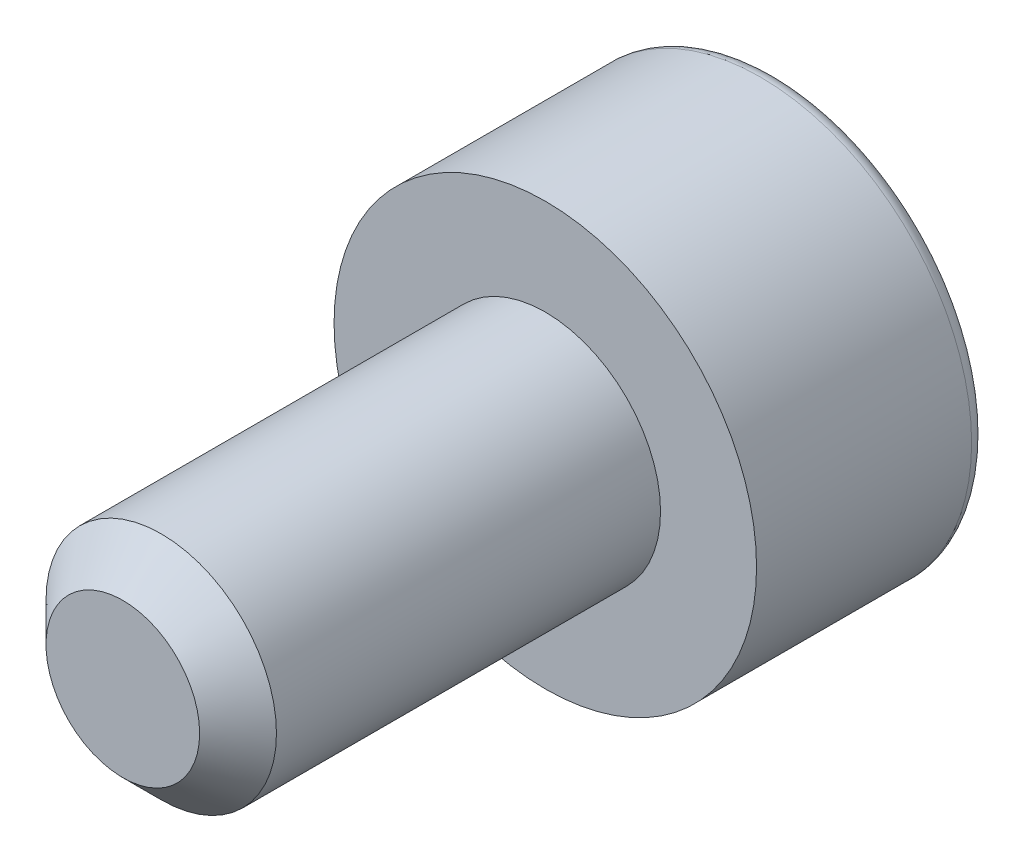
from build123d import *

# Parameters (mm, degrees)
ESQUISSE1_R             = 2.75
BASE_EXTRUSION_DEPTH    = 3
ESQUISSE2_R             = 1.5
BOSS_EXTRU_1_DEPTH      = 5.5
CHANFREIN2_SIZE         = 0.5
ENL_V_MAT_EXTRU_1_DEPTH = 1.9
CONG_1_R                = 0.2


with BuildPart() as part:
    # Esquisse1 → Base-Extrusion (new body)
    with BuildSketch(Plane.XY):
        Circle(ESQUISSE1_R)
    extrude(amount=BASE_EXTRUSION_DEPTH)

    # Esquisse2 → Boss.-Extru.1 (add)
    with BuildSketch(Plane.XY.offset(3)):
        Circle(ESQUISSE2_R)
    extrude(amount=BOSS_EXTRU_1_DEPTH)

    # Chanfrein2
    chanfrein2_edges = [part.edges().sort_by_distance(p)[0] for p in [
        (-1.5, 0, 8.5),
    ]]
    chamfer(chanfrein2_edges, length=CHANFREIN2_SIZE)

    # Esquisse3 → Enl_v. mat.-Extru.1 (cut)
    with BuildSketch(Plane(origin=(0, 0, 0), x_dir=(-1, 0, 0), z_dir=(0, 0, -1))):
        Polygon((-0.721687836, -1.25), (0.721687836, -1.25), (1.443375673, 0), (0.721687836, 1.25), (-0.721687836, 1.25), (-1.443375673, 0), align=None)
    extrude(amount=-ENL_V_MAT_EXTRU_1_DEPTH, mode=Mode.SUBTRACT)

    # Cong_1
    cong_1_edges = [part.edges().sort_by_distance(p)[0] for p in [
        (-2.75, 0, 0),
        (1.082531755, -0.625, 0),
        (1.082531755, 0.625, 0),
        (0, 1.25, 0),
        (-1.082531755, 0.625, 0),
        (-1.082531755, -0.625, 0),
        (0, -1.25, 0),
    ]]
    fillet(cong_1_edges, radius=CONG_1_R)

    # Esquisse4 → Enl_vement de mati_re-R_volution1 (revolve, cut)
    with BuildSketch(Plane(origin=(0, 0, 0), x_dir=(1, 0, 0), z_dir=(0, 1, 0)), mode=Mode.PRIVATE) as enl_vement_de_mati_re_r_volution1_sk:
        Polygon((1.443375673, -1.9), (0, -1.9), (0, -2.5), align=None)
    revolve(enl_vement_de_mati_re_r_volution1_sk.sketch.rotate(Axis((0, 0, 0), (0, 0, 1)), 180), axis=Axis((0, 0, 0), (0, 0, 1)), mode=Mode.SUBTRACT)


solid = part.part
